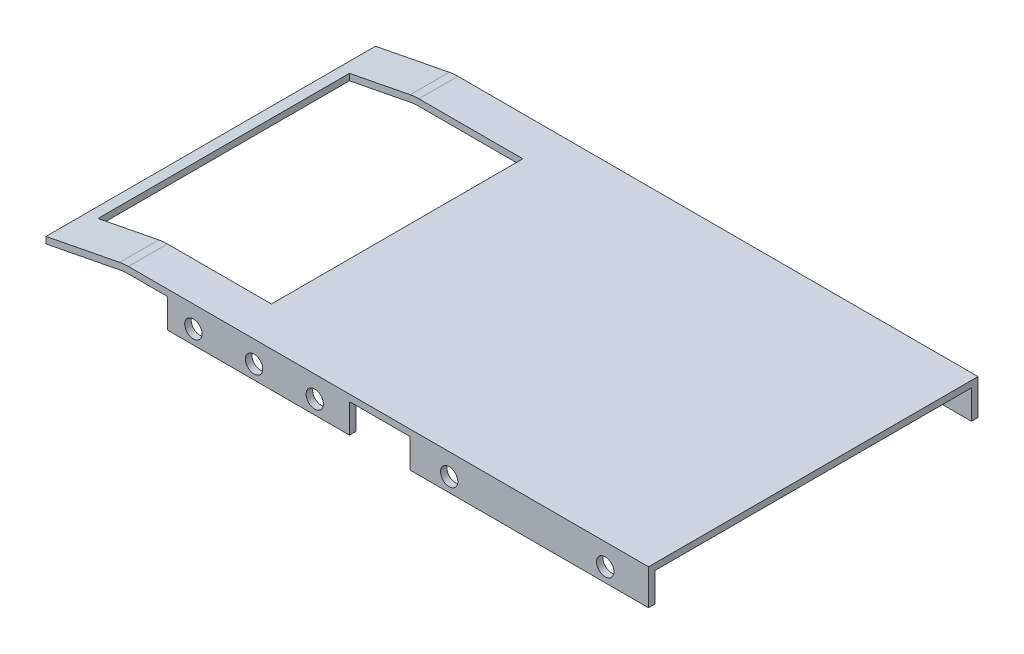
ISO-10303-21;
HEADER;
FILE_DESCRIPTION(('STEP AP214'),'2;1');
FILE_NAME('part.step','',(''),(''),'','','');
FILE_SCHEMA(('AUTOMOTIVE_DESIGN { 1 0 10303 214 1 1 1 1 }'));
ENDSEC;
DATA;
#1=APPLICATION_CONTEXT('core data for automotive mechanical design processes');
#2=APPLICATION_PROTOCOL_DEFINITION('international standard','automotive_design',2000,#1);
#3=PRODUCT_CONTEXT('',#1,'mechanical');
#4=PRODUCT('Part','Part','',(#3));
#5=PRODUCT_RELATED_PRODUCT_CATEGORY('part','',(#4));
#6=PRODUCT_DEFINITION_FORMATION('','',#4);
#7=PRODUCT_DEFINITION_CONTEXT('part definition',#1,'design');
#8=PRODUCT_DEFINITION('design','',#6,#7);
#9=PRODUCT_DEFINITION_SHAPE('','',#8);
#10=(LENGTH_UNIT() NAMED_UNIT(*) SI_UNIT(.MILLI.,.METRE.));
#11=(NAMED_UNIT(*) PLANE_ANGLE_UNIT() SI_UNIT($,.RADIAN.));
#12=(NAMED_UNIT(*) SI_UNIT($,.STERADIAN.) SOLID_ANGLE_UNIT());
#13=UNCERTAINTY_MEASURE_WITH_UNIT(LENGTH_MEASURE(1.E-05),#10,'distance_accuracy_value','');
#14=(GEOMETRIC_REPRESENTATION_CONTEXT(3) GLOBAL_UNCERTAINTY_ASSIGNED_CONTEXT((#13)) GLOBAL_UNIT_ASSIGNED_CONTEXT((#10,
#11,#12)) REPRESENTATION_CONTEXT('',''));
#15=CARTESIAN_POINT('',(0.,0.,0.));
#16=DIRECTION('',(0.,0.,1.));
#17=DIRECTION('',(1.,0.,0.));
#18=AXIS2_PLACEMENT_3D('',#15,#16,#17);
#19=CARTESIAN_POINT('',(0.818721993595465,-8.5,38.));
#20=DIRECTION('',(0.,0.,1.));
#21=DIRECTION('',(1.,0.,0.));
#22=AXIS2_PLACEMENT_3D('',#19,#20,#21);
#23=CYLINDRICAL_SURFACE('',#22,8.5);
#24=DIRECTION('',(0.,0.,-1.));
#25=VECTOR('',#24,1.);
#26=CARTESIAN_POINT('',(0.818721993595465,0.,-38.));
#27=LINE('',#26,#25);
#28=CARTESIAN_POINT('',(0.818721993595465,0.,-29.));
#29=VERTEX_POINT('',#28);
#30=CARTESIAN_POINT('',(0.818721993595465,0.,-38.));
#31=VERTEX_POINT('',#30);
#32=EDGE_CURVE('E480',#29,#31,#27,.T.);
#33=ORIENTED_EDGE('',*,*,#32,.F.);
#34=CARTESIAN_POINT('',(0.818721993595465,-8.5,-29.));
#35=DIRECTION('',(0.,0.,-1.));
#36=DIRECTION('',(-1.,0.,0.));
#37=AXIS2_PLACEMENT_3D('',#34,#35,#36);
#38=CIRCLE('',#37,8.5);
#39=CARTESIAN_POINT('',(-0.803670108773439,-0.156269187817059,-29.));
#40=VERTEX_POINT('',#39);
#41=EDGE_CURVE('E505',#29,#40,#38,.F.);
#42=ORIENTED_EDGE('',*,*,#41,.T.);
#43=DIRECTION('',(0.,0.,-1.));
#44=VECTOR('',#43,1.);
#45=CARTESIAN_POINT('',(-0.803670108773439,-0.156269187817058,38.));
#46=LINE('',#45,#44);
#47=CARTESIAN_POINT('',(-0.803670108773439,-0.156269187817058,-38.));
#48=VERTEX_POINT('',#47);
#49=EDGE_CURVE('E485',#48,#40,#46,.F.);
#50=ORIENTED_EDGE('',*,*,#49,.F.);
#51=CARTESIAN_POINT('',(0.818721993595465,-8.5,-38.));
#52=DIRECTION('',(0.,0.,-1.));
#53=DIRECTION('',(-1.,0.,0.));
#54=AXIS2_PLACEMENT_3D('',#51,#52,#53);
#55=CIRCLE('',#54,8.5);
#56=EDGE_CURVE('E488',#31,#48,#55,.F.);
#57=ORIENTED_EDGE('',*,*,#56,.F.);
#58=EDGE_LOOP('',(#33,#42,#50,#57));
#59=FACE_BOUND('',#58,.T.);
#60=ADVANCED_FACE('F32',(#59),#23,.F.);
#61=CARTESIAN_POINT('',(0.,0.,38.));
#62=DIRECTION('',(0.,1.,0.));
#63=DIRECTION('',(0.,0.,1.));
#64=AXIS2_PLACEMENT_3D('',#61,#62,#63);
#65=PLANE('',#64);
#66=DIRECTION('',(0.,0.,-1.));
#67=VECTOR('',#66,1.);
#68=CARTESIAN_POINT('',(25.,0.,38.));
#69=LINE('',#68,#67);
#70=CARTESIAN_POINT('',(25.,0.,29.));
#71=VERTEX_POINT('',#70);
#72=CARTESIAN_POINT('',(25.,0.,-29.));
#73=VERTEX_POINT('',#72);
#74=EDGE_CURVE('E240',#71,#73,#69,.T.);
#75=ORIENTED_EDGE('',*,*,#74,.T.);
#76=DIRECTION('',(-1.,0.,0.));
#77=VECTOR('',#76,1.);
#78=CARTESIAN_POINT('',(0.,0.,-29.));
#79=LINE('',#78,#77);
#80=EDGE_CURVE('E267',#73,#29,#79,.T.);
#81=ORIENTED_EDGE('',*,*,#80,.T.);
#82=ORIENTED_EDGE('',*,*,#32,.T.);
#83=DIRECTION('',(1.,0.,0.));
#84=VECTOR('',#83,1.);
#85=CARTESIAN_POINT('',(0.,0.,-38.));
#86=LINE('',#85,#84);
#87=CARTESIAN_POINT('',(10.,0.,-38.));
#88=VERTEX_POINT('',#87);
#89=EDGE_CURVE('E458',#31,#88,#86,.T.);
#90=ORIENTED_EDGE('',*,*,#89,.T.);
#91=DIRECTION('',(0.,0.,-1.));
#92=VECTOR('',#91,1.);
#93=CARTESIAN_POINT('',(10.,0.,-38.));
#94=LINE('',#93,#92);
#95=CARTESIAN_POINT('',(10.,0.,-36.5));
#96=VERTEX_POINT('',#95);
#97=EDGE_CURVE('E388',#96,#88,#94,.T.);
#98=ORIENTED_EDGE('',*,*,#97,.F.);
#99=DIRECTION('',(-1.,0.,0.));
#100=VECTOR('',#99,1.);
#101=CARTESIAN_POINT('',(52.,0.,-36.5));
#102=LINE('',#101,#100);
#103=CARTESIAN_POINT('',(52.,0.,-36.5));
#104=VERTEX_POINT('',#103);
#105=EDGE_CURVE('E385',#104,#96,#102,.T.);
#106=ORIENTED_EDGE('',*,*,#105,.F.);
#107=DIRECTION('',(0.,0.,1.));
#108=VECTOR('',#107,1.);
#109=CARTESIAN_POINT('',(52.,0.,-38.));
#110=LINE('',#109,#108);
#111=CARTESIAN_POINT('',(52.,0.,-38.));
#112=VERTEX_POINT('',#111);
#113=EDGE_CURVE('E382',#112,#104,#110,.T.);
#114=ORIENTED_EDGE('',*,*,#113,.F.);
#115=CARTESIAN_POINT('',(66.,0.,-38.));
#116=VERTEX_POINT('',#115);
#117=EDGE_CURVE('E457',#112,#116,#86,.T.);
#118=ORIENTED_EDGE('',*,*,#117,.T.);
#119=DIRECTION('',(0.,0.,-1.));
#120=VECTOR('',#119,1.);
#121=CARTESIAN_POINT('',(66.,0.,-38.));
#122=LINE('',#121,#120);
#123=CARTESIAN_POINT('',(66.,0.,-36.5));
#124=VERTEX_POINT('',#123);
#125=EDGE_CURVE('E415',#124,#116,#122,.T.);
#126=ORIENTED_EDGE('',*,*,#125,.F.);
#127=DIRECTION('',(-1.,0.,0.));
#128=VECTOR('',#127,1.);
#129=CARTESIAN_POINT('',(121.,0.,-36.5));
#130=LINE('',#129,#128);
#131=CARTESIAN_POINT('',(121.,0.,-36.5));
#132=VERTEX_POINT('',#131);
#133=EDGE_CURVE('E412',#132,#124,#130,.T.);
#134=ORIENTED_EDGE('',*,*,#133,.F.);
#135=DIRECTION('',(0.,0.,-1.));
#136=VECTOR('',#135,1.);
#137=CARTESIAN_POINT('',(121.,0.,38.));
#138=LINE('',#137,#136);
#139=CARTESIAN_POINT('',(121.,0.,36.5));
#140=VERTEX_POINT('',#139);
#141=EDGE_CURVE('E478',#140,#132,#138,.T.);
#142=ORIENTED_EDGE('',*,*,#141,.F.);
#143=DIRECTION('',(-1.,0.,0.));
#144=VECTOR('',#143,1.);
#145=CARTESIAN_POINT('',(121.,0.,36.5));
#146=LINE('',#145,#144);
#147=CARTESIAN_POINT('',(66.,0.,36.5));
#148=VERTEX_POINT('',#147);
#149=EDGE_CURVE('E360',#140,#148,#146,.T.);
#150=ORIENTED_EDGE('',*,*,#149,.T.);
#151=DIRECTION('',(0.,0.,1.));
#152=VECTOR('',#151,1.);
#153=CARTESIAN_POINT('',(66.,0.,38.));
#154=LINE('',#153,#152);
#155=CARTESIAN_POINT('',(66.,0.,38.));
#156=VERTEX_POINT('',#155);
#157=EDGE_CURVE('E357',#148,#156,#154,.T.);
#158=ORIENTED_EDGE('',*,*,#157,.T.);
#159=DIRECTION('',(1.,0.,0.));
#160=VECTOR('',#159,1.);
#161=CARTESIAN_POINT('',(0.,0.,38.));
#162=LINE('',#161,#160);
#163=CARTESIAN_POINT('',(52.,0.,38.));
#164=VERTEX_POINT('',#163);
#165=EDGE_CURVE('E465',#164,#156,#162,.T.);
#166=ORIENTED_EDGE('',*,*,#165,.F.);
#167=DIRECTION('',(0.,0.,-1.));
#168=VECTOR('',#167,1.);
#169=CARTESIAN_POINT('',(52.,0.,38.));
#170=LINE('',#169,#168);
#171=CARTESIAN_POINT('',(52.,0.,36.5));
#172=VERTEX_POINT('',#171);
#173=EDGE_CURVE('E327',#164,#172,#170,.T.);
#174=ORIENTED_EDGE('',*,*,#173,.T.);
#175=DIRECTION('',(-1.,0.,0.));
#176=VECTOR('',#175,1.);
#177=CARTESIAN_POINT('',(52.,0.,36.5));
#178=LINE('',#177,#176);
#179=CARTESIAN_POINT('',(10.,0.,36.5));
#180=VERTEX_POINT('',#179);
#181=EDGE_CURVE('E333',#172,#180,#178,.T.);
#182=ORIENTED_EDGE('',*,*,#181,.T.);
#183=DIRECTION('',(0.,0.,1.));
#184=VECTOR('',#183,1.);
#185=CARTESIAN_POINT('',(10.,0.,38.));
#186=LINE('',#185,#184);
#187=CARTESIAN_POINT('',(10.,0.,38.));
#188=VERTEX_POINT('',#187);
#189=EDGE_CURVE('E330',#180,#188,#186,.T.);
#190=ORIENTED_EDGE('',*,*,#189,.T.);
#191=CARTESIAN_POINT('',(0.818721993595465,0.,38.));
#192=VERTEX_POINT('',#191);
#193=EDGE_CURVE('E466',#192,#188,#162,.T.);
#194=ORIENTED_EDGE('',*,*,#193,.F.);
#195=CARTESIAN_POINT('',(0.818721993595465,0.,29.));
#196=VERTEX_POINT('',#195);
#197=EDGE_CURVE('E481',#192,#196,#27,.T.);
#198=ORIENTED_EDGE('',*,*,#197,.T.);
#199=DIRECTION('',(1.,0.,0.));
#200=VECTOR('',#199,1.);
#201=CARTESIAN_POINT('',(0.,0.,29.));
#202=LINE('',#201,#200);
#203=EDGE_CURVE('E260',#196,#71,#202,.T.);
#204=ORIENTED_EDGE('',*,*,#203,.T.);
#205=EDGE_LOOP('',(#75,#81,#82,#90,#98,#106,#114,#118,#126,#134,#142,#150,#158,#166,#174,#182,
#190,#194,#198,#204));
#206=FACE_BOUND('',#205,.T.);
#207=ADVANCED_FACE('F34',(#206),#65,.F.);
#208=CARTESIAN_POINT('',(121.,0.,38.));
#209=DIRECTION('',(-1.,0.,0.));
#210=DIRECTION('',(0.,0.,1.));
#211=AXIS2_PLACEMENT_3D('',#208,#209,#210);
#212=PLANE('',#211);
#213=DIRECTION('',(0.,1.,0.));
#214=VECTOR('',#213,1.);
#215=CARTESIAN_POINT('',(121.,0.,-38.));
#216=LINE('',#215,#214);
#217=CARTESIAN_POINT('',(121.,-6.7,-38.));
#218=VERTEX_POINT('',#217);
#219=CARTESIAN_POINT('',(121.,1.5,-38.));
#220=VERTEX_POINT('',#219);
#221=EDGE_CURVE('E460',#218,#220,#216,.T.);
#222=ORIENTED_EDGE('',*,*,#221,.T.);
#223=DIRECTION('',(0.,0.,-1.));
#224=VECTOR('',#223,1.);
#225=CARTESIAN_POINT('',(121.,1.5,38.));
#226=LINE('',#225,#224);
#227=CARTESIAN_POINT('',(121.,1.5,38.));
#228=VERTEX_POINT('',#227);
#229=EDGE_CURVE('E474',#228,#220,#226,.T.);
#230=ORIENTED_EDGE('',*,*,#229,.F.);
#231=DIRECTION('',(0.,1.,0.));
#232=VECTOR('',#231,1.);
#233=CARTESIAN_POINT('',(121.,0.,38.));
#234=LINE('',#233,#232);
#235=CARTESIAN_POINT('',(121.,-6.7,38.));
#236=VERTEX_POINT('',#235);
#237=EDGE_CURVE('E469',#236,#228,#234,.T.);
#238=ORIENTED_EDGE('',*,*,#237,.F.);
#239=DIRECTION('',(0.,0.,-1.));
#240=VECTOR('',#239,1.);
#241=CARTESIAN_POINT('',(121.,-6.7,38.));
#242=LINE('',#241,#240);
#243=CARTESIAN_POINT('',(121.,-6.7,36.5));
#244=VERTEX_POINT('',#243);
#245=EDGE_CURVE('E363',#236,#244,#242,.T.);
#246=ORIENTED_EDGE('',*,*,#245,.T.);
#247=DIRECTION('',(0.,1.,0.));
#248=VECTOR('',#247,1.);
#249=CARTESIAN_POINT('',(121.,-6.7,36.5));
#250=LINE('',#249,#248);
#251=EDGE_CURVE('E375',#244,#140,#250,.T.);
#252=ORIENTED_EDGE('',*,*,#251,.T.);
#253=ORIENTED_EDGE('',*,*,#141,.T.);
#254=DIRECTION('',(0.,1.,0.));
#255=VECTOR('',#254,1.);
#256=CARTESIAN_POINT('',(121.,-6.7,-36.5));
#257=LINE('',#256,#255);
#258=CARTESIAN_POINT('',(121.,-6.7,-36.5));
#259=VERTEX_POINT('',#258);
#260=EDGE_CURVE('E434',#259,#132,#257,.T.);
#261=ORIENTED_EDGE('',*,*,#260,.F.);
#262=DIRECTION('',(0.,0.,1.));
#263=VECTOR('',#262,1.);
#264=CARTESIAN_POINT('',(121.,-6.7,-38.));
#265=LINE('',#264,#263);
#266=EDGE_CURVE('E418',#218,#259,#265,.T.);
#267=ORIENTED_EDGE('',*,*,#266,.F.);
#268=EDGE_LOOP('',(#222,#230,#238,#246,#252,#253,#261,#267));
#269=FACE_BOUND('',#268,.T.);
#270=ADVANCED_FACE('F541',(#269),#212,.F.);
#271=CARTESIAN_POINT('',(0.,1.5,38.));
#272=DIRECTION('',(0.,-1.,0.));
#273=DIRECTION('',(0.,0.,-1.));
#274=AXIS2_PLACEMENT_3D('',#271,#272,#273);
#275=PLANE('',#274);
#276=DIRECTION('',(-1.,0.,0.));
#277=VECTOR('',#276,1.);
#278=CARTESIAN_POINT('',(0.,1.5,-38.));
#279=LINE('',#278,#277);
#280=CARTESIAN_POINT('',(1.01136246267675,1.5,-38.));
#281=VERTEX_POINT('',#280);
#282=EDGE_CURVE('E463',#220,#281,#279,.T.);
#283=ORIENTED_EDGE('',*,*,#282,.T.);
#284=DIRECTION('',(0.,0.,-1.));
#285=VECTOR('',#284,1.);
#286=CARTESIAN_POINT('',(1.01136246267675,1.5,38.));
#287=LINE('',#286,#285);
#288=CARTESIAN_POINT('',(1.01136246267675,1.5,-29.));
#289=VERTEX_POINT('',#288);
#290=EDGE_CURVE('E520',#281,#289,#287,.F.);
#291=ORIENTED_EDGE('',*,*,#290,.T.);
#292=DIRECTION('',(-1.,0.,0.));
#293=VECTOR('',#292,1.);
#294=CARTESIAN_POINT('',(-15.,1.5,-29.));
#295=LINE('',#294,#293);
#296=CARTESIAN_POINT('',(25.,1.5,-29.));
#297=VERTEX_POINT('',#296);
#298=EDGE_CURVE('E247',#297,#289,#295,.T.);
#299=ORIENTED_EDGE('',*,*,#298,.F.);
#300=DIRECTION('',(0.,0.,-1.));
#301=VECTOR('',#300,1.);
#302=CARTESIAN_POINT('',(25.,1.5,-29.));
#303=LINE('',#302,#301);
#304=CARTESIAN_POINT('',(25.,1.5,29.));
#305=VERTEX_POINT('',#304);
#306=EDGE_CURVE('E232',#305,#297,#303,.T.);
#307=ORIENTED_EDGE('',*,*,#306,.F.);
#308=DIRECTION('',(1.,0.,0.));
#309=VECTOR('',#308,1.);
#310=CARTESIAN_POINT('',(-15.,1.5,29.));
#311=LINE('',#310,#309);
#312=CARTESIAN_POINT('',(1.01136246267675,1.5,29.));
#313=VERTEX_POINT('',#312);
#314=EDGE_CURVE('E226',#313,#305,#311,.T.);
#315=ORIENTED_EDGE('',*,*,#314,.F.);
#316=DIRECTION('',(0.,0.,-1.));
#317=VECTOR('',#316,1.);
#318=CARTESIAN_POINT('',(1.01136246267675,1.5,38.));
#319=LINE('',#318,#317);
#320=CARTESIAN_POINT('',(1.01136246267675,1.5,38.));
#321=VERTEX_POINT('',#320);
#322=EDGE_CURVE('E47',#313,#321,#319,.F.);
#323=ORIENTED_EDGE('',*,*,#322,.T.);
#324=DIRECTION('',(-1.,0.,0.));
#325=VECTOR('',#324,1.);
#326=CARTESIAN_POINT('',(0.,1.5,38.));
#327=LINE('',#326,#325);
#328=EDGE_CURVE('E471',#228,#321,#327,.T.);
#329=ORIENTED_EDGE('',*,*,#328,.F.);
#330=ORIENTED_EDGE('',*,*,#229,.T.);
#331=EDGE_LOOP('',(#283,#291,#299,#307,#315,#323,#329,#330));
#332=FACE_BOUND('',#331,.T.);
#333=ADVANCED_FACE('F245',(#332),#275,.F.);
#334=CARTESIAN_POINT('',(0.,1.5,38.));
#335=DIRECTION('',(0.,0.,-1.));
#336=DIRECTION('',(-1.,0.,0.));
#337=AXIS2_PLACEMENT_3D('',#334,#335,#336);
#338=PLANE('',#337);
#339=CARTESIAN_POINT('',(16.,-3.5,38.));
#340=DIRECTION('',(0.,0.,1.));
#341=DIRECTION('',(1.,0.,0.));
#342=AXIS2_PLACEMENT_3D('',#339,#340,#341);
#343=CIRCLE('',#342,2.);
#344=CARTESIAN_POINT('',(18.,-3.5,38.));
#345=VERTEX_POINT('',#344);
#346=EDGE_CURVE('E277',#345,#345,#343,.T.);
#347=ORIENTED_EDGE('',*,*,#346,.F.);
#348=EDGE_LOOP('',(#347));
#349=FACE_BOUND('',#348,.T.);
#350=CARTESIAN_POINT('',(111.,-3.5,38.));
#351=DIRECTION('',(0.,0.,1.));
#352=DIRECTION('',(1.,0.,0.));
#353=AXIS2_PLACEMENT_3D('',#350,#351,#352);
#354=CIRCLE('',#353,2.);
#355=CARTESIAN_POINT('',(113.,-3.5,38.));
#356=VERTEX_POINT('',#355);
#357=EDGE_CURVE('E287',#356,#356,#354,.T.);
#358=ORIENTED_EDGE('',*,*,#357,.F.);
#359=EDGE_LOOP('',(#358));
#360=FACE_BOUND('',#359,.T.);
#361=CARTESIAN_POINT('',(75.,-3.5,38.));
#362=DIRECTION('',(0.,0.,1.));
#363=DIRECTION('',(1.,0.,0.));
#364=AXIS2_PLACEMENT_3D('',#361,#362,#363);
#365=CIRCLE('',#364,2.);
#366=CARTESIAN_POINT('',(77.,-3.5,38.));
#367=VERTEX_POINT('',#366);
#368=EDGE_CURVE('E297',#367,#367,#365,.T.);
#369=ORIENTED_EDGE('',*,*,#368,.F.);
#370=EDGE_LOOP('',(#369));
#371=FACE_BOUND('',#370,.T.);
#372=CARTESIAN_POINT('',(44.,-3.5,38.));
#373=DIRECTION('',(0.,0.,1.));
#374=DIRECTION('',(1.,0.,0.));
#375=AXIS2_PLACEMENT_3D('',#372,#373,#374);
#376=CIRCLE('',#375,2.);
#377=CARTESIAN_POINT('',(46.,-3.5,38.));
#378=VERTEX_POINT('',#377);
#379=EDGE_CURVE('E307',#378,#378,#376,.T.);
#380=ORIENTED_EDGE('',*,*,#379,.F.);
#381=EDGE_LOOP('',(#380));
#382=FACE_BOUND('',#381,.T.);
#383=CARTESIAN_POINT('',(30.,-3.5,38.));
#384=DIRECTION('',(0.,0.,1.));
#385=DIRECTION('',(1.,0.,0.));
#386=AXIS2_PLACEMENT_3D('',#383,#384,#385);
#387=CIRCLE('',#386,2.);
#388=CARTESIAN_POINT('',(32.,-3.5,38.));
#389=VERTEX_POINT('',#388);
#390=EDGE_CURVE('E317',#389,#389,#387,.T.);
#391=ORIENTED_EDGE('',*,*,#390,.F.);
#392=EDGE_LOOP('',(#391));
#393=FACE_BOUND('',#392,.T.);
#394=ORIENTED_EDGE('',*,*,#328,.T.);
#395=CARTESIAN_POINT('',(1.01136246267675,-9.,38.));
#396=DIRECTION('',(0.,0.,-1.));
#397=DIRECTION('',(-1.,0.,0.));
#398=AXIS2_PLACEMENT_3D('',#395,#396,#397);
#399=CIRCLE('',#398,10.5);
#400=CARTESIAN_POINT('',(-0.992768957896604,1.3069615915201,38.));
#401=VERTEX_POINT('',#400);
#402=EDGE_CURVE('E11',#321,#401,#399,.F.);
#403=ORIENTED_EDGE('',*,*,#402,.T.);
#404=DIRECTION('',(-0.981615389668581,-0.190869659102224,0.));
#405=VECTOR('',#404,1.);
#406=CARTESIAN_POINT('',(0.,1.5,38.));
#407=LINE('',#406,#405);
#408=CARTESIAN_POINT('',(-18.,-2.,38.));
#409=VERTEX_POINT('',#408);
#410=EDGE_CURVE('E444',#401,#409,#407,.T.);
#411=ORIENTED_EDGE('',*,*,#410,.T.);
#412=DIRECTION('',(0.,-1.,0.));
#413=VECTOR('',#412,1.);
#414=CARTESIAN_POINT('',(-18.,-2.,38.));
#415=LINE('',#414,#413);
#416=CARTESIAN_POINT('',(-18.,-3.5,38.));
#417=VERTEX_POINT('',#416);
#418=EDGE_CURVE('E446',#409,#417,#415,.T.);
#419=ORIENTED_EDGE('',*,*,#418,.T.);
#420=DIRECTION('',(0.981615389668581,0.190869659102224,0.));
#421=VECTOR('',#420,1.);
#422=CARTESIAN_POINT('',(0.,0.,38.));
#423=LINE('',#422,#421);
#424=CARTESIAN_POINT('',(-0.803670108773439,-0.156269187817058,38.));
#425=VERTEX_POINT('',#424);
#426=EDGE_CURVE('E448',#417,#425,#423,.T.);
#427=ORIENTED_EDGE('',*,*,#426,.T.);
#428=CARTESIAN_POINT('',(0.818721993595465,-8.5,38.));
#429=DIRECTION('',(0.,0.,-1.));
#430=DIRECTION('',(-1.,0.,0.));
#431=AXIS2_PLACEMENT_3D('',#428,#429,#430);
#432=CIRCLE('',#431,8.5);
#433=EDGE_CURVE('E490',#425,#192,#432,.T.);
#434=ORIENTED_EDGE('',*,*,#433,.T.);
#435=ORIENTED_EDGE('',*,*,#193,.T.);
#436=DIRECTION('',(0.,1.,0.));
#437=VECTOR('',#436,1.);
#438=CARTESIAN_POINT('',(10.,-6.7,38.));
#439=LINE('',#438,#437);
#440=CARTESIAN_POINT('',(10.,-6.7,38.));
#441=VERTEX_POINT('',#440);
#442=EDGE_CURVE('E352',#441,#188,#439,.T.);
#443=ORIENTED_EDGE('',*,*,#442,.F.);
#444=DIRECTION('',(1.,0.,0.));
#445=VECTOR('',#444,1.);
#446=CARTESIAN_POINT('',(52.,-6.7,38.));
#447=LINE('',#446,#445);
#448=CARTESIAN_POINT('',(52.,-6.7,38.));
#449=VERTEX_POINT('',#448);
#450=EDGE_CURVE('E339',#441,#449,#447,.T.);
#451=ORIENTED_EDGE('',*,*,#450,.T.);
#452=DIRECTION('',(0.,1.,0.));
#453=VECTOR('',#452,1.);
#454=CARTESIAN_POINT('',(52.,-6.7,38.));
#455=LINE('',#454,#453);
#456=EDGE_CURVE('E354',#449,#164,#455,.T.);
#457=ORIENTED_EDGE('',*,*,#456,.T.);
#458=ORIENTED_EDGE('',*,*,#165,.T.);
#459=DIRECTION('',(0.,1.,0.));
#460=VECTOR('',#459,1.);
#461=CARTESIAN_POINT('',(66.,-6.7,38.));
#462=LINE('',#461,#460);
#463=CARTESIAN_POINT('',(66.,-6.7,38.));
#464=VERTEX_POINT('',#463);
#465=EDGE_CURVE('E379',#464,#156,#462,.T.);
#466=ORIENTED_EDGE('',*,*,#465,.F.);
#467=DIRECTION('',(1.,0.,0.));
#468=VECTOR('',#467,1.);
#469=CARTESIAN_POINT('',(121.,-6.7,38.));
#470=LINE('',#469,#468);
#471=EDGE_CURVE('E366',#464,#236,#470,.T.);
#472=ORIENTED_EDGE('',*,*,#471,.T.);
#473=ORIENTED_EDGE('',*,*,#237,.T.);
#474=EDGE_LOOP('',(#394,#403,#411,#419,#427,#434,#435,#443,#451,#457,#458,#466,#472,#473));
#475=FACE_BOUND('',#474,.T.);
#476=ADVANCED_FACE('F607',(#349,#360,#371,#382,#393,#475),#338,.F.);
#477=CARTESIAN_POINT('',(0.,1.5,-38.));
#478=DIRECTION('',(0.,0.,-1.));
#479=DIRECTION('',(-1.,0.,0.));
#480=AXIS2_PLACEMENT_3D('',#477,#478,#479);
#481=PLANE('',#480);
#482=CARTESIAN_POINT('',(16.,-3.5,-38.));
#483=DIRECTION('',(0.,0.,1.));
#484=DIRECTION('',(1.,0.,0.));
#485=AXIS2_PLACEMENT_3D('',#482,#483,#484);
#486=CIRCLE('',#485,2.);
#487=CARTESIAN_POINT('',(18.,-3.5,-38.));
#488=VERTEX_POINT('',#487);
#489=EDGE_CURVE('E280',#488,#488,#486,.T.);
#490=ORIENTED_EDGE('',*,*,#489,.T.);
#491=EDGE_LOOP('',(#490));
#492=FACE_BOUND('',#491,.T.);
#493=CARTESIAN_POINT('',(111.,-3.5,-38.));
#494=DIRECTION('',(0.,0.,1.));
#495=DIRECTION('',(1.,0.,0.));
#496=AXIS2_PLACEMENT_3D('',#493,#494,#495);
#497=CIRCLE('',#496,2.);
#498=CARTESIAN_POINT('',(113.,-3.5,-38.));
#499=VERTEX_POINT('',#498);
#500=EDGE_CURVE('E290',#499,#499,#497,.T.);
#501=ORIENTED_EDGE('',*,*,#500,.T.);
#502=EDGE_LOOP('',(#501));
#503=FACE_BOUND('',#502,.T.);
#504=CARTESIAN_POINT('',(75.,-3.5,-38.));
#505=DIRECTION('',(0.,0.,1.));
#506=DIRECTION('',(1.,0.,0.));
#507=AXIS2_PLACEMENT_3D('',#504,#505,#506);
#508=CIRCLE('',#507,2.);
#509=CARTESIAN_POINT('',(77.,-3.5,-38.));
#510=VERTEX_POINT('',#509);
#511=EDGE_CURVE('E300',#510,#510,#508,.T.);
#512=ORIENTED_EDGE('',*,*,#511,.T.);
#513=EDGE_LOOP('',(#512));
#514=FACE_BOUND('',#513,.T.);
#515=CARTESIAN_POINT('',(44.,-3.5,-38.));
#516=DIRECTION('',(0.,0.,1.));
#517=DIRECTION('',(1.,0.,0.));
#518=AXIS2_PLACEMENT_3D('',#515,#516,#517);
#519=CIRCLE('',#518,2.);
#520=CARTESIAN_POINT('',(46.,-3.5,-38.));
#521=VERTEX_POINT('',#520);
#522=EDGE_CURVE('E310',#521,#521,#519,.T.);
#523=ORIENTED_EDGE('',*,*,#522,.T.);
#524=EDGE_LOOP('',(#523));
#525=FACE_BOUND('',#524,.T.);
#526=CARTESIAN_POINT('',(30.,-3.5,-38.));
#527=DIRECTION('',(0.,0.,1.));
#528=DIRECTION('',(1.,0.,0.));
#529=AXIS2_PLACEMENT_3D('',#526,#527,#528);
#530=CIRCLE('',#529,2.);
#531=CARTESIAN_POINT('',(32.,-3.5,-38.));
#532=VERTEX_POINT('',#531);
#533=EDGE_CURVE('E320',#532,#532,#530,.T.);
#534=ORIENTED_EDGE('',*,*,#533,.T.);
#535=EDGE_LOOP('',(#534));
#536=FACE_BOUND('',#535,.T.);
#537=DIRECTION('',(-0.981615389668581,-0.190869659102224,0.));
#538=VECTOR('',#537,1.);
#539=CARTESIAN_POINT('',(0.,1.5,-38.));
#540=LINE('',#539,#538);
#541=CARTESIAN_POINT('',(-0.992768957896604,1.3069615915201,-38.));
#542=VERTEX_POINT('',#541);
#543=CARTESIAN_POINT('',(-18.,-2.,-38.));
#544=VERTEX_POINT('',#543);
#545=EDGE_CURVE('E437',#542,#544,#540,.T.);
#546=ORIENTED_EDGE('',*,*,#545,.F.);
#547=CARTESIAN_POINT('',(1.01136246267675,-9.,-38.));
#548=DIRECTION('',(0.,0.,-1.));
#549=DIRECTION('',(-1.,0.,0.));
#550=AXIS2_PLACEMENT_3D('',#547,#548,#549);
#551=CIRCLE('',#550,10.5);
#552=EDGE_CURVE('E517',#542,#281,#551,.T.);
#553=ORIENTED_EDGE('',*,*,#552,.T.);
#554=ORIENTED_EDGE('',*,*,#282,.F.);
#555=ORIENTED_EDGE('',*,*,#221,.F.);
#556=DIRECTION('',(1.,0.,0.));
#557=VECTOR('',#556,1.);
#558=CARTESIAN_POINT('',(121.,-6.7,-38.));
#559=LINE('',#558,#557);
#560=CARTESIAN_POINT('',(66.,-6.7,-38.));
#561=VERTEX_POINT('',#560);
#562=EDGE_CURVE('E425',#561,#218,#559,.T.);
#563=ORIENTED_EDGE('',*,*,#562,.F.);
#564=DIRECTION('',(0.,1.,0.));
#565=VECTOR('',#564,1.);
#566=CARTESIAN_POINT('',(66.,-6.7,-38.));
#567=LINE('',#566,#565);
#568=EDGE_CURVE('E428',#561,#116,#567,.T.);
#569=ORIENTED_EDGE('',*,*,#568,.T.);
#570=ORIENTED_EDGE('',*,*,#117,.F.);
#571=DIRECTION('',(0.,1.,0.));
#572=VECTOR('',#571,1.);
#573=CARTESIAN_POINT('',(52.,-6.7,-38.));
#574=LINE('',#573,#572);
#575=CARTESIAN_POINT('',(52.,-6.7,-38.));
#576=VERTEX_POINT('',#575);
#577=EDGE_CURVE('E400',#576,#112,#574,.T.);
#578=ORIENTED_EDGE('',*,*,#577,.F.);
#579=DIRECTION('',(1.,0.,0.));
#580=VECTOR('',#579,1.);
#581=CARTESIAN_POINT('',(52.,-6.7,-38.));
#582=LINE('',#581,#580);
#583=CARTESIAN_POINT('',(10.,-6.7,-38.));
#584=VERTEX_POINT('',#583);
#585=EDGE_CURVE('E398',#584,#576,#582,.T.);
#586=ORIENTED_EDGE('',*,*,#585,.F.);
#587=DIRECTION('',(0.,1.,0.));
#588=VECTOR('',#587,1.);
#589=CARTESIAN_POINT('',(10.,-6.7,-38.));
#590=LINE('',#589,#588);
#591=EDGE_CURVE('E403',#584,#88,#590,.T.);
#592=ORIENTED_EDGE('',*,*,#591,.T.);
#593=ORIENTED_EDGE('',*,*,#89,.F.);
#594=ORIENTED_EDGE('',*,*,#56,.T.);
#595=DIRECTION('',(0.981615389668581,0.190869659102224,0.));
#596=VECTOR('',#595,1.);
#597=CARTESIAN_POINT('',(0.,0.,-38.));
#598=LINE('',#597,#596);
#599=CARTESIAN_POINT('',(-18.,-3.5,-38.));
#600=VERTEX_POINT('',#599);
#601=EDGE_CURVE('E441',#600,#48,#598,.T.);
#602=ORIENTED_EDGE('',*,*,#601,.F.);
#603=DIRECTION('',(0.,-1.,0.));
#604=VECTOR('',#603,1.);
#605=CARTESIAN_POINT('',(-18.,-2.,-38.));
#606=LINE('',#605,#604);
#607=EDGE_CURVE('E439',#544,#600,#606,.T.);
#608=ORIENTED_EDGE('',*,*,#607,.F.);
#609=EDGE_LOOP('',(#546,#553,#554,#555,#563,#569,#570,#578,#586,#592,#593,#594,#602,#608));
#610=FACE_BOUND('',#609,.T.);
#611=ADVANCED_FACE('F537',(#492,#503,#514,#525,#536,#610),#481,.T.);
#612=CARTESIAN_POINT('',(0.,1.5,38.));
#613=DIRECTION('',(0.190869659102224,-0.981615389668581,0.));
#614=DIRECTION('',(0.981615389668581,0.190869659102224,0.));
#615=AXIS2_PLACEMENT_3D('',#612,#613,#614);
#616=PLANE('',#615);
#617=DIRECTION('',(0.981615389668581,0.190869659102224,0.));
#618=VECTOR('',#617,1.);
#619=CARTESIAN_POINT('',(0.,1.5,-29.));
#620=LINE('',#619,#618);
#621=CARTESIAN_POINT('',(-15.,-1.41666666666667,-29.));
#622=VERTEX_POINT('',#621);
#623=CARTESIAN_POINT('',(-0.992768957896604,1.3069615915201,-29.));
#624=VERTEX_POINT('',#623);
#625=EDGE_CURVE('E270',#622,#624,#620,.T.);
#626=ORIENTED_EDGE('',*,*,#625,.T.);
#627=DIRECTION('',(0.,0.,-1.));
#628=VECTOR('',#627,1.);
#629=CARTESIAN_POINT('',(-0.992768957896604,1.3069615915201,38.));
#630=LINE('',#629,#628);
#631=EDGE_CURVE('E514',#624,#542,#630,.T.);
#632=ORIENTED_EDGE('',*,*,#631,.T.);
#633=ORIENTED_EDGE('',*,*,#545,.T.);
#634=DIRECTION('',(0.,0.,-1.));
#635=VECTOR('',#634,1.);
#636=CARTESIAN_POINT('',(-18.,-2.,38.));
#637=LINE('',#636,#635);
#638=EDGE_CURVE('E454',#409,#544,#637,.T.);
#639=ORIENTED_EDGE('',*,*,#638,.F.);
#640=ORIENTED_EDGE('',*,*,#410,.F.);
#641=DIRECTION('',(0.,0.,-1.));
#642=VECTOR('',#641,1.);
#643=CARTESIAN_POINT('',(-0.992768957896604,1.3069615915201,38.));
#644=LINE('',#643,#642);
#645=CARTESIAN_POINT('',(-0.992768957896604,1.3069615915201,29.));
#646=VERTEX_POINT('',#645);
#647=EDGE_CURVE('E511',#401,#646,#644,.T.);
#648=ORIENTED_EDGE('',*,*,#647,.T.);
#649=DIRECTION('',(-0.981615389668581,-0.190869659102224,0.));
#650=VECTOR('',#649,1.);
#651=CARTESIAN_POINT('',(0.,1.5,29.));
#652=LINE('',#651,#650);
#653=CARTESIAN_POINT('',(-15.,-1.41666666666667,29.));
#654=VERTEX_POINT('',#653);
#655=EDGE_CURVE('E262',#646,#654,#652,.T.);
#656=ORIENTED_EDGE('',*,*,#655,.T.);
#657=DIRECTION('',(0.,0.,-1.));
#658=VECTOR('',#657,1.);
#659=CARTESIAN_POINT('',(-15.,-1.41666666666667,38.));
#660=LINE('',#659,#658);
#661=EDGE_CURVE('E273',#654,#622,#660,.T.);
#662=ORIENTED_EDGE('',*,*,#661,.T.);
#663=EDGE_LOOP('',(#626,#632,#633,#639,#640,#648,#656,#662));
#664=FACE_BOUND('',#663,.T.);
#665=ADVANCED_FACE('F531',(#664),#616,.F.);
#666=CARTESIAN_POINT('',(-18.,-2.,38.));
#667=DIRECTION('',(1.,0.,0.));
#668=DIRECTION('',(0.,0.,-1.));
#669=AXIS2_PLACEMENT_3D('',#666,#667,#668);
#670=PLANE('',#669);
#671=ORIENTED_EDGE('',*,*,#607,.T.);
#672=DIRECTION('',(0.,0.,-1.));
#673=VECTOR('',#672,1.);
#674=CARTESIAN_POINT('',(-18.,-3.5,38.));
#675=LINE('',#674,#673);
#676=EDGE_CURVE('E451',#417,#600,#675,.T.);
#677=ORIENTED_EDGE('',*,*,#676,.F.);
#678=ORIENTED_EDGE('',*,*,#418,.F.);
#679=ORIENTED_EDGE('',*,*,#638,.T.);
#680=EDGE_LOOP('',(#671,#677,#678,#679));
#681=FACE_BOUND('',#680,.T.);
#682=ADVANCED_FACE('F600',(#681),#670,.F.);
#683=CARTESIAN_POINT('',(0.,0.,38.));
#684=DIRECTION('',(-0.190869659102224,0.981615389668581,0.));
#685=DIRECTION('',(-0.981615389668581,-0.190869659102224,0.));
#686=AXIS2_PLACEMENT_3D('',#683,#684,#685);
#687=PLANE('',#686);
#688=ORIENTED_EDGE('',*,*,#49,.T.);
#689=DIRECTION('',(-0.981615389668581,-0.190869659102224,0.));
#690=VECTOR('',#689,1.);
#691=CARTESIAN_POINT('',(0.,0.,-29.));
#692=LINE('',#691,#690);
#693=CARTESIAN_POINT('',(-15.,-2.91666666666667,-29.));
#694=VERTEX_POINT('',#693);
#695=EDGE_CURVE('E264',#40,#694,#692,.T.);
#696=ORIENTED_EDGE('',*,*,#695,.T.);
#697=DIRECTION('',(0.,0.,1.));
#698=VECTOR('',#697,1.);
#699=CARTESIAN_POINT('',(-15.,-2.91666666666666,38.));
#700=LINE('',#699,#698);
#701=CARTESIAN_POINT('',(-15.,-2.91666666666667,29.));
#702=VERTEX_POINT('',#701);
#703=EDGE_CURVE('E508',#694,#702,#700,.T.);
#704=ORIENTED_EDGE('',*,*,#703,.T.);
#705=DIRECTION('',(0.981615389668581,0.190869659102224,0.));
#706=VECTOR('',#705,1.);
#707=CARTESIAN_POINT('',(0.,0.,29.));
#708=LINE('',#707,#706);
#709=CARTESIAN_POINT('',(-0.803670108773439,-0.156269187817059,29.));
#710=VERTEX_POINT('',#709);
#711=EDGE_CURVE('E254',#702,#710,#708,.T.);
#712=ORIENTED_EDGE('',*,*,#711,.T.);
#713=EDGE_CURVE('E484',#710,#425,#46,.F.);
#714=ORIENTED_EDGE('',*,*,#713,.T.);
#715=ORIENTED_EDGE('',*,*,#426,.F.);
#716=ORIENTED_EDGE('',*,*,#676,.T.);
#717=ORIENTED_EDGE('',*,*,#601,.T.);
#718=EDGE_LOOP('',(#688,#696,#704,#712,#714,#715,#716,#717));
#719=FACE_BOUND('',#718,.T.);
#720=ADVANCED_FACE('F593',(#719),#687,.F.);
#721=ORIENTED_EDGE('',*,*,#713,.F.);
#722=CARTESIAN_POINT('',(0.818721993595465,-8.5,29.));
#723=DIRECTION('',(0.,0.,1.));
#724=DIRECTION('',(1.,0.,0.));
#725=AXIS2_PLACEMENT_3D('',#722,#723,#724);
#726=CIRCLE('',#725,8.5);
#727=EDGE_CURVE('E492',#710,#196,#726,.F.);
#728=ORIENTED_EDGE('',*,*,#727,.T.);
#729=ORIENTED_EDGE('',*,*,#197,.F.);
#730=ORIENTED_EDGE('',*,*,#433,.F.);
#731=EDGE_LOOP('',(#721,#728,#729,#730));
#732=FACE_BOUND('',#731,.T.);
#733=ADVANCED_FACE('F584',(#732),#23,.F.);
#734=CARTESIAN_POINT('',(121.,-6.7,-36.5));
#735=DIRECTION('',(0.,0.,-1.));
#736=DIRECTION('',(-1.,0.,0.));
#737=AXIS2_PLACEMENT_3D('',#734,#735,#736);
#738=PLANE('',#737);
#739=CARTESIAN_POINT('',(111.,-3.5,-36.5));
#740=DIRECTION('',(0.,0.,-1.));
#741=DIRECTION('',(-1.,0.,0.));
#742=AXIS2_PLACEMENT_3D('',#739,#740,#741);
#743=CIRCLE('',#742,2.);
#744=CARTESIAN_POINT('',(109.,-3.5,-36.5));
#745=VERTEX_POINT('',#744);
#746=EDGE_CURVE('E294',#745,#745,#743,.T.);
#747=ORIENTED_EDGE('',*,*,#746,.T.);
#748=EDGE_LOOP('',(#747));
#749=FACE_BOUND('',#748,.T.);
#750=CARTESIAN_POINT('',(75.,-3.5,-36.5));
#751=DIRECTION('',(0.,0.,-1.));
#752=DIRECTION('',(-1.,0.,0.));
#753=AXIS2_PLACEMENT_3D('',#750,#751,#752);
#754=CIRCLE('',#753,2.);
#755=CARTESIAN_POINT('',(73.,-3.5,-36.5));
#756=VERTEX_POINT('',#755);
#757=EDGE_CURVE('E304',#756,#756,#754,.T.);
#758=ORIENTED_EDGE('',*,*,#757,.T.);
#759=EDGE_LOOP('',(#758));
#760=FACE_BOUND('',#759,.T.);
#761=ORIENTED_EDGE('',*,*,#133,.T.);
#762=DIRECTION('',(0.,1.,0.));
#763=VECTOR('',#762,1.);
#764=CARTESIAN_POINT('',(66.,-6.7,-36.5));
#765=LINE('',#764,#763);
#766=CARTESIAN_POINT('',(66.,-6.7,-36.5));
#767=VERTEX_POINT('',#766);
#768=EDGE_CURVE('E431',#767,#124,#765,.T.);
#769=ORIENTED_EDGE('',*,*,#768,.F.);
#770=DIRECTION('',(-1.,0.,0.));
#771=VECTOR('',#770,1.);
#772=CARTESIAN_POINT('',(121.,-6.7,-36.5));
#773=LINE('',#772,#771);
#774=EDGE_CURVE('E421',#259,#767,#773,.T.);
#775=ORIENTED_EDGE('',*,*,#774,.F.);
#776=ORIENTED_EDGE('',*,*,#260,.T.);
#777=EDGE_LOOP('',(#761,#769,#775,#776));
#778=FACE_BOUND('',#777,.T.);
#779=ADVANCED_FACE('F592',(#749,#760,#778),#738,.F.);
#780=CARTESIAN_POINT('',(66.,-6.7,-38.));
#781=DIRECTION('',(1.,0.,0.));
#782=DIRECTION('',(0.,0.,-1.));
#783=AXIS2_PLACEMENT_3D('',#780,#781,#782);
#784=PLANE('',#783);
#785=ORIENTED_EDGE('',*,*,#125,.T.);
#786=ORIENTED_EDGE('',*,*,#568,.F.);
#787=DIRECTION('',(0.,0.,-1.));
#788=VECTOR('',#787,1.);
#789=CARTESIAN_POINT('',(66.,-6.7,-38.));
#790=LINE('',#789,#788);
#791=EDGE_CURVE('E423',#767,#561,#790,.T.);
#792=ORIENTED_EDGE('',*,*,#791,.F.);
#793=ORIENTED_EDGE('',*,*,#768,.T.);
#794=EDGE_LOOP('',(#785,#786,#792,#793));
#795=FACE_BOUND('',#794,.T.);
#796=ADVANCED_FACE('F552',(#795),#784,.F.);
#797=CARTESIAN_POINT('',(121.,-6.7,-38.));
#798=DIRECTION('',(0.,-1.,0.));
#799=DIRECTION('',(0.,0.,-1.));
#800=AXIS2_PLACEMENT_3D('',#797,#798,#799);
#801=PLANE('',#800);
#802=ORIENTED_EDGE('',*,*,#266,.T.);
#803=ORIENTED_EDGE('',*,*,#774,.T.);
#804=ORIENTED_EDGE('',*,*,#791,.T.);
#805=ORIENTED_EDGE('',*,*,#562,.T.);
#806=EDGE_LOOP('',(#802,#803,#804,#805));
#807=FACE_BOUND('',#806,.T.);
#808=ADVANCED_FACE('F547',(#807),#801,.T.);
#809=CARTESIAN_POINT('',(52.,-6.7,-38.));
#810=DIRECTION('',(-1.,0.,0.));
#811=DIRECTION('',(0.,0.,1.));
#812=AXIS2_PLACEMENT_3D('',#809,#810,#811);
#813=PLANE('',#812);
#814=ORIENTED_EDGE('',*,*,#113,.T.);
#815=DIRECTION('',(0.,1.,0.));
#816=VECTOR('',#815,1.);
#817=CARTESIAN_POINT('',(52.,-6.7,-36.5));
#818=LINE('',#817,#816);
#819=CARTESIAN_POINT('',(52.,-6.7,-36.5));
#820=VERTEX_POINT('',#819);
#821=EDGE_CURVE('E409',#820,#104,#818,.T.);
#822=ORIENTED_EDGE('',*,*,#821,.F.);
#823=DIRECTION('',(0.,0.,1.));
#824=VECTOR('',#823,1.);
#825=CARTESIAN_POINT('',(52.,-6.7,-38.));
#826=LINE('',#825,#824);
#827=EDGE_CURVE('E391',#576,#820,#826,.T.);
#828=ORIENTED_EDGE('',*,*,#827,.F.);
#829=ORIENTED_EDGE('',*,*,#577,.T.);
#830=EDGE_LOOP('',(#814,#822,#828,#829));
#831=FACE_BOUND('',#830,.T.);
#832=ADVANCED_FACE('F560',(#831),#813,.F.);
#833=CARTESIAN_POINT('',(52.,-6.7,-36.5));
#834=DIRECTION('',(0.,0.,-1.));
#835=DIRECTION('',(-1.,0.,0.));
#836=AXIS2_PLACEMENT_3D('',#833,#834,#835);
#837=PLANE('',#836);
#838=CARTESIAN_POINT('',(16.,-3.5,-36.5));
#839=DIRECTION('',(0.,0.,-1.));
#840=DIRECTION('',(-1.,0.,0.));
#841=AXIS2_PLACEMENT_3D('',#838,#839,#840);
#842=CIRCLE('',#841,2.);
#843=CARTESIAN_POINT('',(14.,-3.5,-36.5));
#844=VERTEX_POINT('',#843);
#845=EDGE_CURVE('E284',#844,#844,#842,.T.);
#846=ORIENTED_EDGE('',*,*,#845,.T.);
#847=EDGE_LOOP('',(#846));
#848=FACE_BOUND('',#847,.T.);
#849=CARTESIAN_POINT('',(44.,-3.5,-36.5));
#850=DIRECTION('',(0.,0.,-1.));
#851=DIRECTION('',(-1.,0.,0.));
#852=AXIS2_PLACEMENT_3D('',#849,#850,#851);
#853=CIRCLE('',#852,2.);
#854=CARTESIAN_POINT('',(42.,-3.5,-36.5));
#855=VERTEX_POINT('',#854);
#856=EDGE_CURVE('E314',#855,#855,#853,.T.);
#857=ORIENTED_EDGE('',*,*,#856,.T.);
#858=EDGE_LOOP('',(#857));
#859=FACE_BOUND('',#858,.T.);
#860=CARTESIAN_POINT('',(30.,-3.5,-36.5));
#861=DIRECTION('',(0.,0.,-1.));
#862=DIRECTION('',(-1.,0.,0.));
#863=AXIS2_PLACEMENT_3D('',#860,#861,#862);
#864=CIRCLE('',#863,2.);
#865=CARTESIAN_POINT('',(28.,-3.5,-36.5));
#866=VERTEX_POINT('',#865);
#867=EDGE_CURVE('E324',#866,#866,#864,.T.);
#868=ORIENTED_EDGE('',*,*,#867,.T.);
#869=EDGE_LOOP('',(#868));
#870=FACE_BOUND('',#869,.T.);
#871=ORIENTED_EDGE('',*,*,#105,.T.);
#872=DIRECTION('',(0.,1.,0.));
#873=VECTOR('',#872,1.);
#874=CARTESIAN_POINT('',(10.,-6.7,-36.5));
#875=LINE('',#874,#873);
#876=CARTESIAN_POINT('',(10.,-6.7,-36.5));
#877=VERTEX_POINT('',#876);
#878=EDGE_CURVE('E406',#877,#96,#875,.T.);
#879=ORIENTED_EDGE('',*,*,#878,.F.);
#880=DIRECTION('',(-1.,0.,0.));
#881=VECTOR('',#880,1.);
#882=CARTESIAN_POINT('',(52.,-6.7,-36.5));
#883=LINE('',#882,#881);
#884=EDGE_CURVE('E394',#820,#877,#883,.T.);
#885=ORIENTED_EDGE('',*,*,#884,.F.);
#886=ORIENTED_EDGE('',*,*,#821,.T.);
#887=EDGE_LOOP('',(#871,#879,#885,#886));
#888=FACE_BOUND('',#887,.T.);
#889=ADVANCED_FACE('F570',(#848,#859,#870,#888),#837,.F.);
#890=CARTESIAN_POINT('',(10.,-6.7,-38.));
#891=DIRECTION('',(1.,0.,0.));
#892=DIRECTION('',(0.,0.,-1.));
#893=AXIS2_PLACEMENT_3D('',#890,#891,#892);
#894=PLANE('',#893);
#895=ORIENTED_EDGE('',*,*,#97,.T.);
#896=ORIENTED_EDGE('',*,*,#591,.F.);
#897=DIRECTION('',(0.,0.,-1.));
#898=VECTOR('',#897,1.);
#899=CARTESIAN_POINT('',(10.,-6.7,-38.));
#900=LINE('',#899,#898);
#901=EDGE_CURVE('E396',#877,#584,#900,.T.);
#902=ORIENTED_EDGE('',*,*,#901,.F.);
#903=ORIENTED_EDGE('',*,*,#878,.T.);
#904=EDGE_LOOP('',(#895,#896,#902,#903));
#905=FACE_BOUND('',#904,.T.);
#906=ADVANCED_FACE('F568',(#905),#894,.F.);
#907=CARTESIAN_POINT('',(52.,-6.7,-36.5));
#908=DIRECTION('',(0.,-1.,0.));
#909=DIRECTION('',(0.,0.,-1.));
#910=AXIS2_PLACEMENT_3D('',#907,#908,#909);
#911=PLANE('',#910);
#912=ORIENTED_EDGE('',*,*,#827,.T.);
#913=ORIENTED_EDGE('',*,*,#884,.T.);
#914=ORIENTED_EDGE('',*,*,#901,.T.);
#915=ORIENTED_EDGE('',*,*,#585,.T.);
#916=EDGE_LOOP('',(#912,#913,#914,#915));
#917=FACE_BOUND('',#916,.T.);
#918=ADVANCED_FACE('F562',(#917),#911,.T.);
#919=CARTESIAN_POINT('',(66.,-6.7,38.));
#920=DIRECTION('',(-1.,0.,0.));
#921=DIRECTION('',(0.,0.,1.));
#922=AXIS2_PLACEMENT_3D('',#919,#920,#921);
#923=PLANE('',#922);
#924=ORIENTED_EDGE('',*,*,#157,.F.);
#925=DIRECTION('',(0.,1.,0.));
#926=VECTOR('',#925,1.);
#927=CARTESIAN_POINT('',(66.,-6.7,36.5));
#928=LINE('',#927,#926);
#929=CARTESIAN_POINT('',(66.,-6.7,36.5));
#930=VERTEX_POINT('',#929);
#931=EDGE_CURVE('E377',#930,#148,#928,.T.);
#932=ORIENTED_EDGE('',*,*,#931,.F.);
#933=DIRECTION('',(0.,0.,1.));
#934=VECTOR('',#933,1.);
#935=CARTESIAN_POINT('',(66.,-6.7,38.));
#936=LINE('',#935,#934);
#937=EDGE_CURVE('E369',#930,#464,#936,.T.);
#938=ORIENTED_EDGE('',*,*,#937,.T.);
#939=ORIENTED_EDGE('',*,*,#465,.T.);
#940=EDGE_LOOP('',(#924,#932,#938,#939));
#941=FACE_BOUND('',#940,.T.);
#942=ADVANCED_FACE('F639',(#941),#923,.T.);
#943=CARTESIAN_POINT('',(121.,-6.7,36.5));
#944=DIRECTION('',(0.,0.,-1.));
#945=DIRECTION('',(-1.,0.,0.));
#946=AXIS2_PLACEMENT_3D('',#943,#944,#945);
#947=PLANE('',#946);
#948=CARTESIAN_POINT('',(111.,-3.5,36.5));
#949=DIRECTION('',(0.,0.,-1.));
#950=DIRECTION('',(-1.,0.,0.));
#951=AXIS2_PLACEMENT_3D('',#948,#949,#950);
#952=CIRCLE('',#951,2.);
#953=CARTESIAN_POINT('',(109.,-3.5,36.5));
#954=VERTEX_POINT('',#953);
#955=EDGE_CURVE('E293',#954,#954,#952,.T.);
#956=ORIENTED_EDGE('',*,*,#955,.F.);
#957=EDGE_LOOP('',(#956));
#958=FACE_BOUND('',#957,.T.);
#959=CARTESIAN_POINT('',(75.,-3.5,36.5));
#960=DIRECTION('',(0.,0.,-1.));
#961=DIRECTION('',(-1.,0.,0.));
#962=AXIS2_PLACEMENT_3D('',#959,#960,#961);
#963=CIRCLE('',#962,2.);
#964=CARTESIAN_POINT('',(73.,-3.5,36.5));
#965=VERTEX_POINT('',#964);
#966=EDGE_CURVE('E303',#965,#965,#963,.T.);
#967=ORIENTED_EDGE('',*,*,#966,.F.);
#968=EDGE_LOOP('',(#967));
#969=FACE_BOUND('',#968,.T.);
#970=ORIENTED_EDGE('',*,*,#149,.F.);
#971=ORIENTED_EDGE('',*,*,#251,.F.);
#972=DIRECTION('',(-1.,0.,0.));
#973=VECTOR('',#972,1.);
#974=CARTESIAN_POINT('',(121.,-6.7,36.5));
#975=LINE('',#974,#973);
#976=EDGE_CURVE('E372',#244,#930,#975,.T.);
#977=ORIENTED_EDGE('',*,*,#976,.T.);
#978=ORIENTED_EDGE('',*,*,#931,.T.);
#979=EDGE_LOOP('',(#970,#971,#977,#978));
#980=FACE_BOUND('',#979,.T.);
#981=ADVANCED_FACE('F647',(#958,#969,#980),#947,.T.);
#982=CARTESIAN_POINT('',(121.,-6.7,38.));
#983=DIRECTION('',(0.,-1.,0.));
#984=DIRECTION('',(0.,0.,1.));
#985=AXIS2_PLACEMENT_3D('',#982,#983,#984);
#986=PLANE('',#985);
#987=ORIENTED_EDGE('',*,*,#245,.F.);
#988=ORIENTED_EDGE('',*,*,#471,.F.);
#989=ORIENTED_EDGE('',*,*,#937,.F.);
#990=ORIENTED_EDGE('',*,*,#976,.F.);
#991=EDGE_LOOP('',(#987,#988,#989,#990));
#992=FACE_BOUND('',#991,.T.);
#993=ADVANCED_FACE('F643',(#992),#986,.T.);
#994=CARTESIAN_POINT('',(52.,-6.7,38.));
#995=DIRECTION('',(1.,0.,0.));
#996=DIRECTION('',(0.,0.,-1.));
#997=AXIS2_PLACEMENT_3D('',#994,#995,#996);
#998=PLANE('',#997);
#999=ORIENTED_EDGE('',*,*,#173,.F.);
#1000=ORIENTED_EDGE('',*,*,#456,.F.);
#1001=DIRECTION('',(0.,0.,-1.));
#1002=VECTOR('',#1001,1.);
#1003=CARTESIAN_POINT('',(52.,-6.7,38.));
#1004=LINE('',#1003,#1002);
#1005=CARTESIAN_POINT('',(52.,-6.7,36.5));
#1006=VERTEX_POINT('',#1005);
#1007=EDGE_CURVE('E336',#449,#1006,#1004,.T.);
#1008=ORIENTED_EDGE('',*,*,#1007,.T.);
#1009=DIRECTION('',(0.,1.,0.));
#1010=VECTOR('',#1009,1.);
#1011=CARTESIAN_POINT('',(52.,-6.7,36.5));
#1012=LINE('',#1011,#1010);
#1013=EDGE_CURVE('E348',#1006,#172,#1012,.T.);
#1014=ORIENTED_EDGE('',*,*,#1013,.T.);
#1015=EDGE_LOOP('',(#999,#1000,#1008,#1014));
#1016=FACE_BOUND('',#1015,.T.);
#1017=ADVANCED_FACE('F633',(#1016),#998,.T.);
#1018=CARTESIAN_POINT('',(10.,-6.7,38.));
#1019=DIRECTION('',(-1.,0.,0.));
#1020=DIRECTION('',(0.,0.,1.));
#1021=AXIS2_PLACEMENT_3D('',#1018,#1019,#1020);
#1022=PLANE('',#1021);
#1023=ORIENTED_EDGE('',*,*,#189,.F.);
#1024=DIRECTION('',(0.,1.,0.));
#1025=VECTOR('',#1024,1.);
#1026=CARTESIAN_POINT('',(10.,-6.7,36.5));
#1027=LINE('',#1026,#1025);
#1028=CARTESIAN_POINT('',(10.,-6.7,36.5));
#1029=VERTEX_POINT('',#1028);
#1030=EDGE_CURVE('E350',#1029,#180,#1027,.T.);
#1031=ORIENTED_EDGE('',*,*,#1030,.F.);
#1032=DIRECTION('',(0.,0.,1.));
#1033=VECTOR('',#1032,1.);
#1034=CARTESIAN_POINT('',(10.,-6.7,38.));
#1035=LINE('',#1034,#1033);
#1036=EDGE_CURVE('E342',#1029,#441,#1035,.T.);
#1037=ORIENTED_EDGE('',*,*,#1036,.T.);
#1038=ORIENTED_EDGE('',*,*,#442,.T.);
#1039=EDGE_LOOP('',(#1023,#1031,#1037,#1038));
#1040=FACE_BOUND('',#1039,.T.);
#1041=ADVANCED_FACE('F628',(#1040),#1022,.T.);
#1042=CARTESIAN_POINT('',(52.,-6.7,36.5));
#1043=DIRECTION('',(0.,0.,-1.));
#1044=DIRECTION('',(-1.,0.,0.));
#1045=AXIS2_PLACEMENT_3D('',#1042,#1043,#1044);
#1046=PLANE('',#1045);
#1047=CARTESIAN_POINT('',(16.,-3.5,36.5));
#1048=DIRECTION('',(0.,0.,-1.));
#1049=DIRECTION('',(-1.,0.,0.));
#1050=AXIS2_PLACEMENT_3D('',#1047,#1048,#1049);
#1051=CIRCLE('',#1050,2.);
#1052=CARTESIAN_POINT('',(14.,-3.5,36.5));
#1053=VERTEX_POINT('',#1052);
#1054=EDGE_CURVE('E283',#1053,#1053,#1051,.T.);
#1055=ORIENTED_EDGE('',*,*,#1054,.F.);
#1056=EDGE_LOOP('',(#1055));
#1057=FACE_BOUND('',#1056,.T.);
#1058=CARTESIAN_POINT('',(44.,-3.5,36.5));
#1059=DIRECTION('',(0.,0.,-1.));
#1060=DIRECTION('',(-1.,0.,0.));
#1061=AXIS2_PLACEMENT_3D('',#1058,#1059,#1060);
#1062=CIRCLE('',#1061,2.);
#1063=CARTESIAN_POINT('',(42.,-3.5,36.5));
#1064=VERTEX_POINT('',#1063);
#1065=EDGE_CURVE('E313',#1064,#1064,#1062,.T.);
#1066=ORIENTED_EDGE('',*,*,#1065,.F.);
#1067=EDGE_LOOP('',(#1066));
#1068=FACE_BOUND('',#1067,.T.);
#1069=CARTESIAN_POINT('',(30.,-3.5,36.5));
#1070=DIRECTION('',(0.,0.,-1.));
#1071=DIRECTION('',(-1.,0.,0.));
#1072=AXIS2_PLACEMENT_3D('',#1069,#1070,#1071);
#1073=CIRCLE('',#1072,2.);
#1074=CARTESIAN_POINT('',(28.,-3.5,36.5));
#1075=VERTEX_POINT('',#1074);
#1076=EDGE_CURVE('E323',#1075,#1075,#1073,.T.);
#1077=ORIENTED_EDGE('',*,*,#1076,.F.);
#1078=EDGE_LOOP('',(#1077));
#1079=FACE_BOUND('',#1078,.T.);
#1080=ORIENTED_EDGE('',*,*,#181,.F.);
#1081=ORIENTED_EDGE('',*,*,#1013,.F.);
#1082=DIRECTION('',(-1.,0.,0.));
#1083=VECTOR('',#1082,1.);
#1084=CARTESIAN_POINT('',(52.,-6.7,36.5));
#1085=LINE('',#1084,#1083);
#1086=EDGE_CURVE('E345',#1006,#1029,#1085,.T.);
#1087=ORIENTED_EDGE('',*,*,#1086,.T.);
#1088=ORIENTED_EDGE('',*,*,#1030,.T.);
#1089=EDGE_LOOP('',(#1080,#1081,#1087,#1088));
#1090=FACE_BOUND('',#1089,.T.);
#1091=ADVANCED_FACE('F631',(#1057,#1068,#1079,#1090),#1046,.T.);
#1092=CARTESIAN_POINT('',(52.,-6.7,36.5));
#1093=DIRECTION('',(0.,-1.,0.));
#1094=DIRECTION('',(0.,0.,1.));
#1095=AXIS2_PLACEMENT_3D('',#1092,#1093,#1094);
#1096=PLANE('',#1095);
#1097=ORIENTED_EDGE('',*,*,#1007,.F.);
#1098=ORIENTED_EDGE('',*,*,#450,.F.);
#1099=ORIENTED_EDGE('',*,*,#1036,.F.);
#1100=ORIENTED_EDGE('',*,*,#1086,.F.);
#1101=EDGE_LOOP('',(#1097,#1098,#1099,#1100));
#1102=FACE_BOUND('',#1101,.T.);
#1103=ADVANCED_FACE('F626',(#1102),#1096,.T.);
#1104=CARTESIAN_POINT('',(30.,-3.5,-38.));
#1105=DIRECTION('',(0.,0.,1.));
#1106=DIRECTION('',(1.,0.,0.));
#1107=AXIS2_PLACEMENT_3D('',#1104,#1105,#1106);
#1108=CYLINDRICAL_SURFACE('',#1107,2.);
#1109=ORIENTED_EDGE('',*,*,#1076,.T.);
#1110=EDGE_LOOP('',(#1109));
#1111=FACE_BOUND('',#1110,.T.);
#1112=ORIENTED_EDGE('',*,*,#390,.T.);
#1113=EDGE_LOOP('',(#1112));
#1114=FACE_BOUND('',#1113,.T.);
#1115=ADVANCED_FACE('F709',(#1111,#1114),#1108,.F.);
#1116=ORIENTED_EDGE('',*,*,#533,.F.);
#1117=EDGE_LOOP('',(#1116));
#1118=FACE_BOUND('',#1117,.T.);
#1119=ORIENTED_EDGE('',*,*,#867,.F.);
#1120=EDGE_LOOP('',(#1119));
#1121=FACE_BOUND('',#1120,.T.);
#1122=ADVANCED_FACE('F743',(#1118,#1121),#1108,.F.);
#1123=CARTESIAN_POINT('',(44.,-3.5,-38.));
#1124=DIRECTION('',(0.,0.,1.));
#1125=DIRECTION('',(1.,0.,0.));
#1126=AXIS2_PLACEMENT_3D('',#1123,#1124,#1125);
#1127=CYLINDRICAL_SURFACE('',#1126,2.);
#1128=ORIENTED_EDGE('',*,*,#1065,.T.);
#1129=EDGE_LOOP('',(#1128));
#1130=FACE_BOUND('',#1129,.T.);
#1131=ORIENTED_EDGE('',*,*,#379,.T.);
#1132=EDGE_LOOP('',(#1131));
#1133=FACE_BOUND('',#1132,.T.);
#1134=ADVANCED_FACE('F753',(#1130,#1133),#1127,.F.);
#1135=ORIENTED_EDGE('',*,*,#522,.F.);
#1136=EDGE_LOOP('',(#1135));
#1137=FACE_BOUND('',#1136,.T.);
#1138=ORIENTED_EDGE('',*,*,#856,.F.);
#1139=EDGE_LOOP('',(#1138));
#1140=FACE_BOUND('',#1139,.T.);
#1141=ADVANCED_FACE('F762',(#1137,#1140),#1127,.F.);
#1142=CARTESIAN_POINT('',(75.,-3.5,-38.));
#1143=DIRECTION('',(0.,0.,1.));
#1144=DIRECTION('',(1.,0.,0.));
#1145=AXIS2_PLACEMENT_3D('',#1142,#1143,#1144);
#1146=CYLINDRICAL_SURFACE('',#1145,2.);
#1147=ORIENTED_EDGE('',*,*,#966,.T.);
#1148=EDGE_LOOP('',(#1147));
#1149=FACE_BOUND('',#1148,.T.);
#1150=ORIENTED_EDGE('',*,*,#368,.T.);
#1151=EDGE_LOOP('',(#1150));
#1152=FACE_BOUND('',#1151,.T.);
#1153=ADVANCED_FACE('F772',(#1149,#1152),#1146,.F.);
#1154=ORIENTED_EDGE('',*,*,#511,.F.);
#1155=EDGE_LOOP('',(#1154));
#1156=FACE_BOUND('',#1155,.T.);
#1157=ORIENTED_EDGE('',*,*,#757,.F.);
#1158=EDGE_LOOP('',(#1157));
#1159=FACE_BOUND('',#1158,.T.);
#1160=ADVANCED_FACE('F781',(#1156,#1159),#1146,.F.);
#1161=CARTESIAN_POINT('',(111.,-3.5,-38.));
#1162=DIRECTION('',(0.,0.,1.));
#1163=DIRECTION('',(1.,0.,0.));
#1164=AXIS2_PLACEMENT_3D('',#1161,#1162,#1163);
#1165=CYLINDRICAL_SURFACE('',#1164,2.);
#1166=ORIENTED_EDGE('',*,*,#955,.T.);
#1167=EDGE_LOOP('',(#1166));
#1168=FACE_BOUND('',#1167,.T.);
#1169=ORIENTED_EDGE('',*,*,#357,.T.);
#1170=EDGE_LOOP('',(#1169));
#1171=FACE_BOUND('',#1170,.T.);
#1172=ADVANCED_FACE('F791',(#1168,#1171),#1165,.F.);
#1173=ORIENTED_EDGE('',*,*,#500,.F.);
#1174=EDGE_LOOP('',(#1173));
#1175=FACE_BOUND('',#1174,.T.);
#1176=ORIENTED_EDGE('',*,*,#746,.F.);
#1177=EDGE_LOOP('',(#1176));
#1178=FACE_BOUND('',#1177,.T.);
#1179=ADVANCED_FACE('F801',(#1175,#1178),#1165,.F.);
#1180=CARTESIAN_POINT('',(16.,-3.5,-38.));
#1181=DIRECTION('',(0.,0.,1.));
#1182=DIRECTION('',(1.,0.,0.));
#1183=AXIS2_PLACEMENT_3D('',#1180,#1181,#1182);
#1184=CYLINDRICAL_SURFACE('',#1183,2.);
#1185=ORIENTED_EDGE('',*,*,#1054,.T.);
#1186=EDGE_LOOP('',(#1185));
#1187=FACE_BOUND('',#1186,.T.);
#1188=ORIENTED_EDGE('',*,*,#346,.T.);
#1189=EDGE_LOOP('',(#1188));
#1190=FACE_BOUND('',#1189,.T.);
#1191=ADVANCED_FACE('F811',(#1187,#1190),#1184,.F.);
#1192=ORIENTED_EDGE('',*,*,#489,.F.);
#1193=EDGE_LOOP('',(#1192));
#1194=FACE_BOUND('',#1193,.T.);
#1195=ORIENTED_EDGE('',*,*,#845,.F.);
#1196=EDGE_LOOP('',(#1195));
#1197=FACE_BOUND('',#1196,.T.);
#1198=ADVANCED_FACE('F821',(#1194,#1197),#1184,.F.);
#1199=CARTESIAN_POINT('',(25.,-6.7,-29.));
#1200=DIRECTION('',(1.,0.,0.));
#1201=DIRECTION('',(0.,0.,-1.));
#1202=AXIS2_PLACEMENT_3D('',#1199,#1200,#1201);
#1203=PLANE('',#1202);
#1204=DIRECTION('',(0.,1.,0.));
#1205=VECTOR('',#1204,1.);
#1206=CARTESIAN_POINT('',(25.,-6.7,29.));
#1207=LINE('',#1206,#1205);
#1208=EDGE_CURVE('E229',#71,#305,#1207,.T.);
#1209=ORIENTED_EDGE('',*,*,#1208,.T.);
#1210=ORIENTED_EDGE('',*,*,#306,.T.);
#1211=DIRECTION('',(0.,1.,0.));
#1212=VECTOR('',#1211,1.);
#1213=CARTESIAN_POINT('',(25.,-6.7,-29.));
#1214=LINE('',#1213,#1212);
#1215=EDGE_CURVE('E241',#73,#297,#1214,.T.);
#1216=ORIENTED_EDGE('',*,*,#1215,.F.);
#1217=ORIENTED_EDGE('',*,*,#74,.F.);
#1218=EDGE_LOOP('',(#1209,#1210,#1216,#1217));
#1219=FACE_BOUND('',#1218,.T.);
#1220=ADVANCED_FACE('F236',(#1219),#1203,.F.);
#1221=CARTESIAN_POINT('',(-15.,-6.7,-29.));
#1222=DIRECTION('',(-1.,0.,0.));
#1223=DIRECTION('',(0.,0.,1.));
#1224=AXIS2_PLACEMENT_3D('',#1221,#1222,#1223);
#1225=PLANE('',#1224);
#1226=DIRECTION('',(0.,1.,0.));
#1227=VECTOR('',#1226,1.);
#1228=CARTESIAN_POINT('',(-15.,-6.7,29.));
#1229=LINE('',#1228,#1227);
#1230=EDGE_CURVE('E242',#702,#654,#1229,.T.);
#1231=ORIENTED_EDGE('',*,*,#1230,.F.);
#1232=ORIENTED_EDGE('',*,*,#703,.F.);
#1233=DIRECTION('',(0.,1.,0.));
#1234=VECTOR('',#1233,1.);
#1235=CARTESIAN_POINT('',(-15.,-6.7,-29.));
#1236=LINE('',#1235,#1234);
#1237=EDGE_CURVE('E251',#694,#622,#1236,.T.);
#1238=ORIENTED_EDGE('',*,*,#1237,.T.);
#1239=ORIENTED_EDGE('',*,*,#661,.F.);
#1240=EDGE_LOOP('',(#1231,#1232,#1238,#1239));
#1241=FACE_BOUND('',#1240,.T.);
#1242=ADVANCED_FACE('F619',(#1241),#1225,.F.);
#1243=CARTESIAN_POINT('',(-15.,-6.7,-29.));
#1244=DIRECTION('',(0.,0.,-1.));
#1245=DIRECTION('',(-1.,0.,0.));
#1246=AXIS2_PLACEMENT_3D('',#1243,#1244,#1245);
#1247=PLANE('',#1246);
#1248=ORIENTED_EDGE('',*,*,#298,.T.);
#1249=CARTESIAN_POINT('',(1.01136246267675,-9.,-29.));
#1250=DIRECTION('',(0.,0.,-1.));
#1251=DIRECTION('',(-1.,0.,0.));
#1252=AXIS2_PLACEMENT_3D('',#1249,#1250,#1251);
#1253=CIRCLE('',#1252,10.5);
#1254=EDGE_CURVE('E522',#289,#624,#1253,.F.);
#1255=ORIENTED_EDGE('',*,*,#1254,.T.);
#1256=ORIENTED_EDGE('',*,*,#625,.F.);
#1257=ORIENTED_EDGE('',*,*,#1237,.F.);
#1258=ORIENTED_EDGE('',*,*,#695,.F.);
#1259=ORIENTED_EDGE('',*,*,#41,.F.);
#1260=ORIENTED_EDGE('',*,*,#80,.F.);
#1261=ORIENTED_EDGE('',*,*,#1215,.T.);
#1262=EDGE_LOOP('',(#1248,#1255,#1256,#1257,#1258,#1259,#1260,#1261));
#1263=FACE_BOUND('',#1262,.T.);
#1264=ADVANCED_FACE('F525',(#1263),#1247,.F.);
#1265=CARTESIAN_POINT('',(-15.,-6.7,29.));
#1266=DIRECTION('',(0.,0.,1.));
#1267=DIRECTION('',(1.,0.,0.));
#1268=AXIS2_PLACEMENT_3D('',#1265,#1266,#1267);
#1269=PLANE('',#1268);
#1270=ORIENTED_EDGE('',*,*,#655,.F.);
#1271=CARTESIAN_POINT('',(1.01136246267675,-9.,29.));
#1272=DIRECTION('',(0.,0.,1.));
#1273=DIRECTION('',(1.,0.,0.));
#1274=AXIS2_PLACEMENT_3D('',#1271,#1272,#1273);
#1275=CIRCLE('',#1274,10.5);
#1276=EDGE_CURVE('E40',#646,#313,#1275,.F.);
#1277=ORIENTED_EDGE('',*,*,#1276,.T.);
#1278=ORIENTED_EDGE('',*,*,#314,.T.);
#1279=ORIENTED_EDGE('',*,*,#1208,.F.);
#1280=ORIENTED_EDGE('',*,*,#203,.F.);
#1281=ORIENTED_EDGE('',*,*,#727,.F.);
#1282=ORIENTED_EDGE('',*,*,#711,.F.);
#1283=ORIENTED_EDGE('',*,*,#1230,.T.);
#1284=EDGE_LOOP('',(#1270,#1277,#1278,#1279,#1280,#1281,#1282,#1283));
#1285=FACE_BOUND('',#1284,.T.);
#1286=ADVANCED_FACE('F228',(#1285),#1269,.F.);
#1287=CARTESIAN_POINT('',(1.01136246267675,-9.,38.));
#1288=DIRECTION('',(0.,0.,-1.));
#1289=DIRECTION('',(-1.,0.,0.));
#1290=AXIS2_PLACEMENT_3D('',#1287,#1288,#1289);
#1291=CYLINDRICAL_SURFACE('',#1290,10.5);
#1292=ORIENTED_EDGE('',*,*,#1254,.F.);
#1293=ORIENTED_EDGE('',*,*,#290,.F.);
#1294=ORIENTED_EDGE('',*,*,#552,.F.);
#1295=ORIENTED_EDGE('',*,*,#631,.F.);
#1296=EDGE_LOOP('',(#1292,#1293,#1294,#1295));
#1297=FACE_BOUND('',#1296,.T.);
#1298=ADVANCED_FACE('F534',(#1297),#1291,.T.);
#1299=CARTESIAN_POINT('',(1.01136246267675,-9.,38.));
#1300=DIRECTION('',(0.,0.,-1.));
#1301=DIRECTION('',(-1.,0.,0.));
#1302=AXIS2_PLACEMENT_3D('',#1299,#1300,#1301);
#1303=CYLINDRICAL_SURFACE('',#1302,10.5);
#1304=ORIENTED_EDGE('',*,*,#402,.F.);
#1305=ORIENTED_EDGE('',*,*,#322,.F.);
#1306=ORIENTED_EDGE('',*,*,#1276,.F.);
#1307=ORIENTED_EDGE('',*,*,#647,.F.);
#1308=EDGE_LOOP('',(#1304,#1305,#1306,#1307));
#1309=FACE_BOUND('',#1308,.T.);
#1310=ADVANCED_FACE('F937',(#1309),#1303,.T.);
#1311=CLOSED_SHELL('',(#60,#207,#270,#333,#476,#611,#665,#682,#720,#733,#779,#796,#808,#832,
#889,#906,#918,#942,#981,#993,#1017,#1041,#1091,#1103,#1115,#1122,#1134,#1141,#1153,#1160,#1172,
#1179,#1191,#1198,#1220,#1242,#1264,#1286,#1298,#1310));
#1312=MANIFOLD_SOLID_BREP('B2',#1311);
#1313=ADVANCED_BREP_SHAPE_REPRESENTATION('',(#18,#1312),#14);
#1314=SHAPE_DEFINITION_REPRESENTATION(#9,#1313);
ENDSEC;
END-ISO-10303-21;
